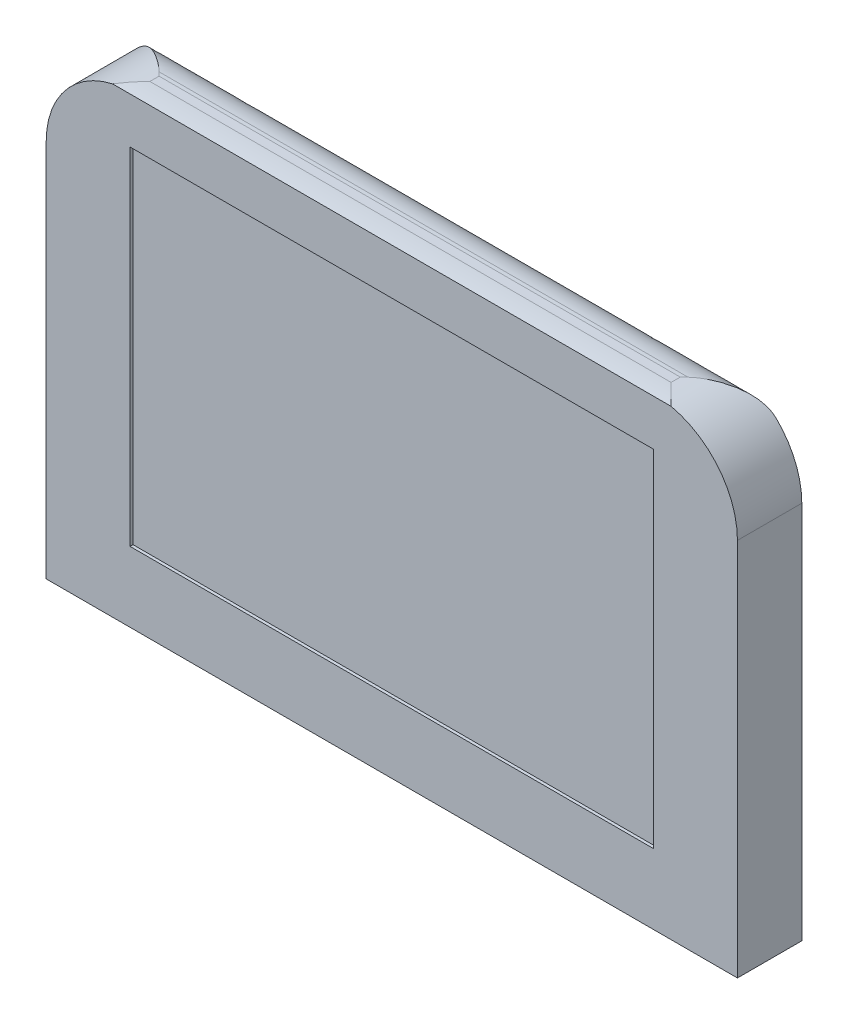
ISO-10303-21;
HEADER;
FILE_DESCRIPTION(('STEP AP214'),'2;1');
FILE_NAME('part.step','',(''),(''),'','','');
FILE_SCHEMA(('AUTOMOTIVE_DESIGN { 1 0 10303 214 1 1 1 1 }'));
ENDSEC;
DATA;
#1=APPLICATION_CONTEXT('core data for automotive mechanical design processes');
#2=APPLICATION_PROTOCOL_DEFINITION('international standard','automotive_design',2000,#1);
#3=PRODUCT_CONTEXT('',#1,'mechanical');
#4=PRODUCT('Part','Part','',(#3));
#5=PRODUCT_RELATED_PRODUCT_CATEGORY('part','',(#4));
#6=PRODUCT_DEFINITION_FORMATION('','',#4);
#7=PRODUCT_DEFINITION_CONTEXT('part definition',#1,'design');
#8=PRODUCT_DEFINITION('design','',#6,#7);
#9=PRODUCT_DEFINITION_SHAPE('','',#8);
#10=(LENGTH_UNIT() NAMED_UNIT(*) SI_UNIT(.MILLI.,.METRE.));
#11=(NAMED_UNIT(*) PLANE_ANGLE_UNIT() SI_UNIT($,.RADIAN.));
#12=(NAMED_UNIT(*) SI_UNIT($,.STERADIAN.) SOLID_ANGLE_UNIT());
#13=UNCERTAINTY_MEASURE_WITH_UNIT(LENGTH_MEASURE(1.E-05),#10,'distance_accuracy_value','');
#14=(GEOMETRIC_REPRESENTATION_CONTEXT(3) GLOBAL_UNCERTAINTY_ASSIGNED_CONTEXT((#13)) GLOBAL_UNIT_ASSIGNED_CONTEXT((#10,
#11,#12)) REPRESENTATION_CONTEXT('',''));
#15=CARTESIAN_POINT('',(0.,0.,0.));
#16=DIRECTION('',(0.,0.,1.));
#17=DIRECTION('',(1.,0.,0.));
#18=AXIS2_PLACEMENT_3D('',#15,#16,#17);
#19=CARTESIAN_POINT('',(0.,-78.2875,10.79));
#20=DIRECTION('',(0.,1.,0.));
#21=DIRECTION('',(-1.,0.,0.));
#22=AXIS2_PLACEMENT_3D('',#19,#20,#21);
#23=CYLINDRICAL_SURFACE('',#22,5.);
#24=CARTESIAN_POINT('',(0.,-78.2875,10.79));
#25=DIRECTION('',(0.,-1.,0.));
#26=DIRECTION('',(1.,0.,0.));
#27=AXIS2_PLACEMENT_3D('',#24,#25,#26);
#28=CIRCLE('',#27,5.);
#29=CARTESIAN_POINT('',(4.99999999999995,-78.2875,10.79));
#30=VERTEX_POINT('',#29);
#31=EDGE_CURVE('E11',#30,#30,#28,.T.);
#32=ORIENTED_EDGE('',*,*,#31,.F.);
#33=EDGE_LOOP('',(#32));
#34=FACE_BOUND('',#33,.T.);
#35=CARTESIAN_POINT('',(0.,-77.7875,10.79));
#36=DIRECTION('',(0.,-1.,0.));
#37=DIRECTION('',(1.,0.,0.));
#38=AXIS2_PLACEMENT_3D('',#35,#36,#37);
#39=CIRCLE('',#38,5.);
#40=CARTESIAN_POINT('',(4.99999999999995,-77.7875,10.79));
#41=VERTEX_POINT('',#40);
#42=EDGE_CURVE('E41',#41,#41,#39,.T.);
#43=ORIENTED_EDGE('',*,*,#42,.T.);
#44=EDGE_LOOP('',(#43));
#45=FACE_BOUND('',#44,.T.);
#46=ADVANCED_FACE('F38',(#34,#45),#23,.T.);
#47=CARTESIAN_POINT('',(0.,-78.2875,10.79));
#48=DIRECTION('',(0.,-1.,0.));
#49=DIRECTION('',(1.,0.,0.));
#50=AXIS2_PLACEMENT_3D('',#47,#48,#49);
#51=PLANE('',#50);
#52=ORIENTED_EDGE('',*,*,#31,.T.);
#53=EDGE_LOOP('',(#52));
#54=FACE_BOUND('',#53,.T.);
#55=ADVANCED_FACE('F53',(#54),#51,.T.);
#56=CARTESIAN_POINT('',(0.,-77.7875,10.79));
#57=DIRECTION('',(0.,-1.,0.));
#58=DIRECTION('',(1.,0.,0.));
#59=AXIS2_PLACEMENT_3D('',#56,#57,#58);
#60=PLANE('',#59);
#61=ORIENTED_EDGE('',*,*,#42,.F.);
#62=EDGE_LOOP('',(#61));
#63=FACE_BOUND('',#62,.T.);
#64=ADVANCED_FACE('F51',(#63),#60,.F.);
#65=CLOSED_SHELL('',(#46,#55,#64));
#66=MANIFOLD_SOLID_BREP('B2',#65);
#67=CARTESIAN_POINT('',(-115.8875,-77.7875,21.58));
#68=DIRECTION('',(1.,0.,0.));
#69=DIRECTION('',(0.,0.,-1.));
#70=AXIS2_PLACEMENT_3D('',#67,#68,#69);
#71=PLANE('',#70);
#72=DIRECTION('',(0.,-1.,0.));
#73=VECTOR('',#72,1.);
#74=CARTESIAN_POINT('',(-115.8875,-77.7875,21.58));
#75=LINE('',#74,#73);
#76=CARTESIAN_POINT('',(-115.8875,49.2875,21.58));
#77=VERTEX_POINT('',#76);
#78=CARTESIAN_POINT('',(-115.8875,-77.7875,21.58));
#79=VERTEX_POINT('',#78);
#80=EDGE_CURVE('E317',#77,#79,#75,.T.);
#81=ORIENTED_EDGE('',*,*,#80,.F.);
#82=DIRECTION('',(0.,0.,-1.));
#83=VECTOR('',#82,1.);
#84=CARTESIAN_POINT('',(-115.8875,49.2875,21.58));
#85=LINE('',#84,#83);
#86=CARTESIAN_POINT('',(-115.8875,49.2875,0.));
#87=VERTEX_POINT('',#86);
#88=EDGE_CURVE('E36',#77,#87,#85,.T.);
#89=ORIENTED_EDGE('',*,*,#88,.T.);
#90=DIRECTION('',(0.,-1.,0.));
#91=VECTOR('',#90,1.);
#92=CARTESIAN_POINT('',(-115.8875,-77.7875,0.));
#93=LINE('',#92,#91);
#94=CARTESIAN_POINT('',(-115.8875,-77.7875,0.));
#95=VERTEX_POINT('',#94);
#96=EDGE_CURVE('E293',#87,#95,#93,.T.);
#97=ORIENTED_EDGE('',*,*,#96,.T.);
#98=DIRECTION('',(0.,0.,-1.));
#99=VECTOR('',#98,1.);
#100=CARTESIAN_POINT('',(-115.8875,-77.7875,21.58));
#101=LINE('',#100,#99);
#102=EDGE_CURVE('E332',#79,#95,#101,.T.);
#103=ORIENTED_EDGE('',*,*,#102,.F.);
#104=EDGE_LOOP('',(#81,#89,#97,#103));
#105=FACE_BOUND('',#104,.T.);
#106=ADVANCED_FACE('F78',(#105),#71,.F.);
#107=CARTESIAN_POINT('',(115.8875,-77.7875,21.58));
#108=DIRECTION('',(0.,1.,0.));
#109=DIRECTION('',(-1.,0.,0.));
#110=AXIS2_PLACEMENT_3D('',#107,#108,#109);
#111=PLANE('',#110);
#112=DIRECTION('',(1.,0.,0.));
#113=VECTOR('',#112,1.);
#114=CARTESIAN_POINT('',(115.8875,-77.7875,0.));
#115=LINE('',#114,#113);
#116=CARTESIAN_POINT('',(115.8875,-77.7875,0.));
#117=VERTEX_POINT('',#116);
#118=EDGE_CURVE('E327',#95,#117,#115,.T.);
#119=ORIENTED_EDGE('',*,*,#118,.T.);
#120=DIRECTION('',(0.,0.,-1.));
#121=VECTOR('',#120,1.);
#122=CARTESIAN_POINT('',(115.8875,-77.7875,21.58));
#123=LINE('',#122,#121);
#124=CARTESIAN_POINT('',(115.8875,-77.7875,21.58));
#125=VERTEX_POINT('',#124);
#126=EDGE_CURVE('E325',#125,#117,#123,.T.);
#127=ORIENTED_EDGE('',*,*,#126,.F.);
#128=DIRECTION('',(1.,0.,0.));
#129=VECTOR('',#128,1.);
#130=CARTESIAN_POINT('',(115.8875,-77.7875,21.58));
#131=LINE('',#130,#129);
#132=EDGE_CURVE('E319',#79,#125,#131,.T.);
#133=ORIENTED_EDGE('',*,*,#132,.F.);
#134=ORIENTED_EDGE('',*,*,#102,.T.);
#135=EDGE_LOOP('',(#119,#127,#133,#134));
#136=FACE_BOUND('',#135,.T.);
#137=ADVANCED_FACE('F266',(#136),#111,.F.);
#138=CARTESIAN_POINT('',(115.8875,-77.7875,21.58));
#139=DIRECTION('',(-1.,0.,0.));
#140=DIRECTION('',(0.,-1.,0.));
#141=AXIS2_PLACEMENT_3D('',#138,#139,#140);
#142=PLANE('',#141);
#143=DIRECTION('',(0.,1.,0.));
#144=VECTOR('',#143,1.);
#145=CARTESIAN_POINT('',(115.8875,-77.7875,0.));
#146=LINE('',#145,#144);
#147=CARTESIAN_POINT('',(115.8875,49.2875,0.));
#148=VERTEX_POINT('',#147);
#149=EDGE_CURVE('E320',#117,#148,#146,.T.);
#150=ORIENTED_EDGE('',*,*,#149,.T.);
#151=DIRECTION('',(0.,0.,-1.));
#152=VECTOR('',#151,1.);
#153=CARTESIAN_POINT('',(115.8875,49.2875,21.58));
#154=LINE('',#153,#152);
#155=CARTESIAN_POINT('',(115.8875,49.2875,21.58));
#156=VERTEX_POINT('',#155);
#157=EDGE_CURVE('E300',#148,#156,#154,.F.);
#158=ORIENTED_EDGE('',*,*,#157,.T.);
#159=DIRECTION('',(0.,1.,0.));
#160=VECTOR('',#159,1.);
#161=CARTESIAN_POINT('',(115.8875,-77.7875,21.58));
#162=LINE('',#161,#160);
#163=EDGE_CURVE('E322',#125,#156,#162,.T.);
#164=ORIENTED_EDGE('',*,*,#163,.F.);
#165=ORIENTED_EDGE('',*,*,#126,.T.);
#166=EDGE_LOOP('',(#150,#158,#164,#165));
#167=FACE_BOUND('',#166,.T.);
#168=ADVANCED_FACE('F270',(#167),#142,.F.);
#169=CARTESIAN_POINT('',(115.8875,77.7875,21.58));
#170=DIRECTION('',(0.,-1.,0.));
#171=DIRECTION('',(1.,0.,0.));
#172=AXIS2_PLACEMENT_3D('',#169,#170,#171);
#173=PLANE('',#172);
#174=DIRECTION('',(0.,0.,-1.));
#175=VECTOR('',#174,1.);
#176=CARTESIAN_POINT('',(87.3874999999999,77.7875,21.58));
#177=LINE('',#176,#175);
#178=CARTESIAN_POINT('',(87.3874999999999,77.7875,15.3258384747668));
#179=VERTEX_POINT('',#178);
#180=CARTESIAN_POINT('',(87.3874999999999,77.7875,12.2468711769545));
#181=VERTEX_POINT('',#180);
#182=EDGE_CURVE('E339',#179,#181,#177,.T.);
#183=ORIENTED_EDGE('',*,*,#182,.T.);
#184=DIRECTION('',(1.,0.,0.));
#185=VECTOR('',#184,1.);
#186=CARTESIAN_POINT('',(115.8875,77.7875,12.2468711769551));
#187=LINE('',#186,#185);
#188=CARTESIAN_POINT('',(-87.3875,77.7875,12.2468711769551));
#189=VERTEX_POINT('',#188);
#190=EDGE_CURVE('E340',#181,#189,#187,.F.);
#191=ORIENTED_EDGE('',*,*,#190,.T.);
#192=DIRECTION('',(0.,0.,-1.));
#193=VECTOR('',#192,1.);
#194=CARTESIAN_POINT('',(-87.3875,77.7875,21.58));
#195=LINE('',#194,#193);
#196=CARTESIAN_POINT('',(-87.3875,77.7875,15.3258384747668));
#197=VERTEX_POINT('',#196);
#198=EDGE_CURVE('E335',#189,#197,#195,.F.);
#199=ORIENTED_EDGE('',*,*,#198,.T.);
#200=DIRECTION('',(1.,0.,0.));
#201=VECTOR('',#200,1.);
#202=CARTESIAN_POINT('',(115.8875,77.7875,15.3258384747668));
#203=LINE('',#202,#201);
#204=EDGE_CURVE('E337',#197,#179,#203,.T.);
#205=ORIENTED_EDGE('',*,*,#204,.T.);
#206=EDGE_LOOP('',(#183,#191,#199,#205));
#207=FACE_BOUND('',#206,.T.);
#208=ADVANCED_FACE('F274',(#207),#173,.F.);
#209=CARTESIAN_POINT('',(-115.8875,77.7875,21.58));
#210=DIRECTION('',(0.,0.,1.));
#211=DIRECTION('',(1.,0.,0.));
#212=AXIS2_PLACEMENT_3D('',#209,#210,#211);
#213=PLANE('',#212);
#214=DIRECTION('',(0.,-1.,0.));
#215=VECTOR('',#214,1.);
#216=CARTESIAN_POINT('',(-87.7875000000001,-54.2875,21.58));
#217=LINE('',#216,#215);
#218=CARTESIAN_POINT('',(-87.7875000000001,61.6928135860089,21.58));
#219=VERTEX_POINT('',#218);
#220=CARTESIAN_POINT('',(-87.7875000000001,-54.2875,21.58));
#221=VERTEX_POINT('',#220);
#222=EDGE_CURVE('E95',#219,#221,#217,.T.);
#223=ORIENTED_EDGE('',*,*,#222,.F.);
#224=DIRECTION('',(-1.,0.,0.));
#225=VECTOR('',#224,1.);
#226=CARTESIAN_POINT('',(87.7874999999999,61.6928135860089,21.58));
#227=LINE('',#226,#225);
#228=CARTESIAN_POINT('',(87.7874999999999,61.6928135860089,21.58));
#229=VERTEX_POINT('',#228);
#230=EDGE_CURVE('E194',#229,#219,#227,.T.);
#231=ORIENTED_EDGE('',*,*,#230,.F.);
#232=DIRECTION('',(0.,1.,0.));
#233=VECTOR('',#232,1.);
#234=CARTESIAN_POINT('',(87.7874999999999,-54.2875,21.58));
#235=LINE('',#234,#233);
#236=CARTESIAN_POINT('',(87.7874999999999,-54.2875,21.58));
#237=VERTEX_POINT('',#236);
#238=EDGE_CURVE('E197',#237,#229,#235,.T.);
#239=ORIENTED_EDGE('',*,*,#238,.F.);
#240=DIRECTION('',(1.,0.,0.));
#241=VECTOR('',#240,1.);
#242=CARTESIAN_POINT('',(87.7874999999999,-54.2875,21.58));
#243=LINE('',#242,#241);
#244=EDGE_CURVE('E203',#221,#237,#243,.T.);
#245=ORIENTED_EDGE('',*,*,#244,.F.);
#246=EDGE_LOOP('',(#223,#231,#239,#245));
#247=FACE_BOUND('',#246,.T.);
#248=ORIENTED_EDGE('',*,*,#163,.T.);
#249=CARTESIAN_POINT('',(87.3874999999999,49.2875,21.58));
#250=DIRECTION('',(0.,0.,1.));
#251=DIRECTION('',(1.,0.,0.));
#252=AXIS2_PLACEMENT_3D('',#249,#250,#251);
#253=CIRCLE('',#252,28.5);
#254=CARTESIAN_POINT('',(93.6416615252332,77.0928135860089,21.58));
#255=VERTEX_POINT('',#254);
#256=EDGE_CURVE('E87',#156,#255,#253,.T.);
#257=ORIENTED_EDGE('',*,*,#256,.T.);
#258=DIRECTION('',(1.,0.,0.));
#259=VECTOR('',#258,1.);
#260=CARTESIAN_POINT('',(-115.8875,77.0928135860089,21.58));
#261=LINE('',#260,#259);
#262=CARTESIAN_POINT('',(-93.6416615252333,77.0928135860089,21.58));
#263=VERTEX_POINT('',#262);
#264=EDGE_CURVE('E294',#263,#255,#261,.T.);
#265=ORIENTED_EDGE('',*,*,#264,.F.);
#266=CARTESIAN_POINT('',(-87.3875,49.2875,21.58));
#267=DIRECTION('',(0.,0.,1.));
#268=DIRECTION('',(1.,0.,0.));
#269=AXIS2_PLACEMENT_3D('',#266,#267,#268);
#270=CIRCLE('',#269,28.5);
#271=EDGE_CURVE('E103',#263,#77,#270,.T.);
#272=ORIENTED_EDGE('',*,*,#271,.T.);
#273=ORIENTED_EDGE('',*,*,#80,.T.);
#274=ORIENTED_EDGE('',*,*,#132,.T.);
#275=EDGE_LOOP('',(#248,#257,#265,#272,#273,#274));
#276=FACE_BOUND('',#275,.T.);
#277=ADVANCED_FACE('F231',(#247,#276),#213,.T.);
#278=CARTESIAN_POINT('',(-115.8875,77.7875,0.));
#279=DIRECTION('',(0.,0.,1.));
#280=DIRECTION('',(1.,0.,0.));
#281=AXIS2_PLACEMENT_3D('',#278,#279,#280);
#282=PLANE('',#281);
#283=DIRECTION('',(1.,0.,0.));
#284=VECTOR('',#283,1.);
#285=CARTESIAN_POINT('',(-115.8875,69.7875,0.));
#286=LINE('',#285,#284);
#287=CARTESIAN_POINT('',(-107.186489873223,69.7875,0.));
#288=VERTEX_POINT('',#287);
#289=CARTESIAN_POINT('',(107.186489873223,69.7875,0.));
#290=VERTEX_POINT('',#289);
#291=EDGE_CURVE('E217',#288,#290,#286,.T.);
#292=ORIENTED_EDGE('',*,*,#291,.T.);
#293=CARTESIAN_POINT('',(87.3874999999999,49.2875,0.));
#294=DIRECTION('',(0.,0.,1.));
#295=DIRECTION('',(1.,0.,0.));
#296=AXIS2_PLACEMENT_3D('',#293,#294,#295);
#297=CIRCLE('',#296,28.5);
#298=EDGE_CURVE('E288',#290,#148,#297,.F.);
#299=ORIENTED_EDGE('',*,*,#298,.T.);
#300=ORIENTED_EDGE('',*,*,#149,.F.);
#301=ORIENTED_EDGE('',*,*,#118,.F.);
#302=ORIENTED_EDGE('',*,*,#96,.F.);
#303=CARTESIAN_POINT('',(-87.3875,49.2875,0.));
#304=DIRECTION('',(0.,0.,1.));
#305=DIRECTION('',(1.,0.,0.));
#306=AXIS2_PLACEMENT_3D('',#303,#304,#305);
#307=CIRCLE('',#306,28.5);
#308=EDGE_CURVE('E248',#87,#288,#307,.F.);
#309=ORIENTED_EDGE('',*,*,#308,.T.);
#310=EDGE_LOOP('',(#292,#299,#300,#301,#302,#309));
#311=FACE_BOUND('',#310,.T.);
#312=ADVANCED_FACE('F228',(#311),#282,.F.);
#313=CARTESIAN_POINT('',(-115.8875,77.0928135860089,21.58));
#314=CARTESIAN_POINT('',(-115.8875,77.9333968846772,19.9146475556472));
#315=CARTESIAN_POINT('',(-115.8875,77.834654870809,15.4470430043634));
#316=CARTESIAN_POINT('',(-115.8875,77.7106660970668,5.20338045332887));
#317=CARTESIAN_POINT('',(-115.8875,73.9504674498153,0.44956625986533));
#318=CARTESIAN_POINT('',(-115.8875,69.9062340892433,-0.0246089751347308));
#319=CARTESIAN_POINT('',(-115.8875,69.0465337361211,0.));
#320=CARTESIAN_POINT('',(-115.8875,67.7874999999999,0.));
#321=B_SPLINE_CURVE_WITH_KNOTS('',3,(#313,#314,#315,#316,#317,#318,#319,#320),.UNSPECIFIED.,.F.,
.F.,(4,1,1,1,1,4),(0.,0.307991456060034,0.403452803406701,0.89337339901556,0.959152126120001,
1.),.UNSPECIFIED.);
#322=DIRECTION('',(1.,0.,0.));
#323=VECTOR('',#322,1.);
#324=SURFACE_OF_LINEAR_EXTRUSION('',#321,#323);
#325=DIRECTION('',(1.,0.,0.));
#326=VECTOR('',#325,1.);
#327=CARTESIAN_POINT('',(-115.8875,77.7576656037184,10.9431570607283));
#328=LINE('',#327,#326);
#329=CARTESIAN_POINT('',(-88.6912141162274,77.7576656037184,10.9431570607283));
#330=VERTEX_POINT('',#329);
#331=CARTESIAN_POINT('',(88.6912141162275,77.7576656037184,10.9431570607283));
#332=VERTEX_POINT('',#331);
#333=EDGE_CURVE('E249',#330,#332,#328,.T.);
#334=ORIENTED_EDGE('',*,*,#333,.T.);
#335=CARTESIAN_POINT('',(88.6912141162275,77.7576656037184,10.9431570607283));
#336=CARTESIAN_POINT('',(88.7523353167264,77.754865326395,10.8819781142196));
#337=CARTESIAN_POINT('',(88.8133824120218,77.7518739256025,10.8207324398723));
#338=CARTESIAN_POINT('',(88.9356208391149,77.7454881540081,10.6983997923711));
#339=CARTESIAN_POINT('',(88.9968121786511,77.7420937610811,10.6373128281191));
#340=CARTESIAN_POINT('',(89.1196300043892,77.7348812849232,10.5155914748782));
#341=CARTESIAN_POINT('',(89.181256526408,77.7310631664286,10.454957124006));
#342=CARTESIAN_POINT('',(89.3050839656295,77.7229835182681,10.3343090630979));
#343=CARTESIAN_POINT('',(89.3672848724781,77.7187219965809,10.2742953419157));
#344=CARTESIAN_POINT('',(89.4922836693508,77.7097413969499,10.1550737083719));
#345=CARTESIAN_POINT('',(89.5550807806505,77.7050228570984,10.0958649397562));
#346=CARTESIAN_POINT('',(89.681386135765,77.6951063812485,9.9782509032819));
#347=CARTESIAN_POINT('',(89.7448943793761,77.6899084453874,9.91984563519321));
#348=CARTESIAN_POINT('',(89.8726584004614,77.6790144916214,9.80391402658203));
#349=CARTESIAN_POINT('',(89.9369141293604,77.6733185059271,9.74638762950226));
#350=CARTESIAN_POINT('',(90.0660729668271,77.6614220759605,9.63211969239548));
#351=CARTESIAN_POINT('',(90.1309760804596,77.6552216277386,9.57537815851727));
#352=CARTESIAN_POINT('',(90.3264191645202,77.6358665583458,9.40611685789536));
#353=CARTESIAN_POINT('',(90.4577077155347,77.6219569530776,9.29454704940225));
#354=CARTESIAN_POINT('',(90.7216449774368,77.5921131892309,9.07329605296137));
#355=CARTESIAN_POINT('',(90.8542937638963,77.5761789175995,8.96361497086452));
#356=CARTESIAN_POINT('',(91.1206273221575,77.5422657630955,8.74574537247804));
#357=CARTESIAN_POINT('',(91.2543124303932,77.5242861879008,8.63755737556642));
#358=CARTESIAN_POINT('',(91.5224393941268,77.4862696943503,8.42249779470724));
#359=CARTESIAN_POINT('',(91.6568812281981,77.4662328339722,8.31562617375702));
#360=CARTESIAN_POINT('',(91.9263944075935,77.4240784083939,8.10304794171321));
#361=CARTESIAN_POINT('',(92.0614658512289,77.4019605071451,7.99734152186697));
#362=CARTESIAN_POINT('',(92.3321097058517,77.3556258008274,7.78703575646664));
#363=CARTESIAN_POINT('',(92.467682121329,77.3314089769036,7.68243642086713));
#364=CARTESIAN_POINT('',(92.8818668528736,77.2543038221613,7.36498848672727));
#365=CARTESIAN_POINT('',(93.1611562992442,77.1980166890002,7.15383524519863));
#366=CARTESIAN_POINT('',(93.7210606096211,77.0763127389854,6.73589422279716));
#367=CARTESIAN_POINT('',(94.0016756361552,77.0108947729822,6.52910699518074));
#368=CARTESIAN_POINT('',(94.5638908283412,76.8707076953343,6.12010433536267));
#369=CARTESIAN_POINT('',(94.8454909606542,76.7959388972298,5.91788875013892));
#370=CARTESIAN_POINT('',(95.4094151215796,76.6368090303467,5.51837274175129));
#371=CARTESIAN_POINT('',(95.6917390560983,76.5524491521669,5.32107171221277));
#372=CARTESIAN_POINT('',(96.2569190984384,76.3738660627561,4.93182595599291));
#373=CARTESIAN_POINT('',(96.5397751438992,76.2796439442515,4.73988063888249));
#374=CARTESIAN_POINT('',(97.0716488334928,76.0930367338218,4.38473409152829));
#375=CARTESIAN_POINT('',(97.3206242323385,76.0018060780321,4.22086274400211));
#376=CARTESIAN_POINT('',(97.8186980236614,75.811285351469,3.89816436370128));
#377=CARTESIAN_POINT('',(98.0677963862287,75.7119967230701,3.73933643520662));
#378=CARTESIAN_POINT('',(98.5659988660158,75.5051258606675,3.42724784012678));
#379=CARTESIAN_POINT('',(98.8151029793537,75.3975445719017,3.27398654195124));
#380=CARTESIAN_POINT('',(99.3132292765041,75.1738194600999,2.97361847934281));
#381=CARTESIAN_POINT('',(99.5622514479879,75.0576746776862,2.82651240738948));
#382=CARTESIAN_POINT('',(100.057091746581,74.8179941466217,2.5408904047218));
#383=CARTESIAN_POINT('',(100.302913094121,74.6945614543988,2.4022937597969));
#384=CARTESIAN_POINT('',(100.794127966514,74.4388221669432,2.13264003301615));
#385=CARTESIAN_POINT('',(101.039521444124,74.3065146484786,2.00158373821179));
#386=CARTESIAN_POINT('',(101.529623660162,74.0327847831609,1.74798122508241));
#387=CARTESIAN_POINT('',(101.7743324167,73.8913626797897,1.62543477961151));
#388=CARTESIAN_POINT('',(102.262854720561,73.5991195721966,1.38992869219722));
#389=CARTESIAN_POINT('',(102.506668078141,73.4482966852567,1.27697098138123));
#390=CARTESIAN_POINT('',(102.939384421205,73.1713761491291,1.08567224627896));
#391=CARTESIAN_POINT('',(103.128544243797,73.0471569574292,1.00518930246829));
#392=CARTESIAN_POINT('',(103.5058519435,72.792828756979,0.851569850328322));
#393=CARTESIAN_POINT('',(103.693999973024,72.6627206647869,0.778432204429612));
#394=CARTESIAN_POINT('',(104.068953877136,72.3966304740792,0.640318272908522));
#395=CARTESIAN_POINT('',(104.255760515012,72.2606520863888,0.575336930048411));
#396=CARTESIAN_POINT('',(104.627728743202,71.9828377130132,0.454405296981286));
#397=CARTESIAN_POINT('',(104.812891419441,71.8410060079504,0.398448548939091));
#398=CARTESIAN_POINT('',(105.184391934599,71.5490670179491,0.295624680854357));
#399=CARTESIAN_POINT('',(105.370698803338,71.398861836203,0.248922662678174));
#400=CARTESIAN_POINT('',(105.741040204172,71.0924380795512,0.16692376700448));
#401=CARTESIAN_POINT('',(105.92507375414,70.9362170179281,0.131631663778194));
#402=CARTESIAN_POINT('',(106.19907575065,70.6975289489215,0.0879650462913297));
#403=CARTESIAN_POINT('',(106.290155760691,70.6171600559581,0.0749466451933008));
#404=CARTESIAN_POINT('',(106.471499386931,70.4550637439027,0.051986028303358));
#405=CARTESIAN_POINT('',(106.561762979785,70.373336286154,0.0420439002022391));
#406=CARTESIAN_POINT('',(106.741691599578,70.2083082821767,0.0251146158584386));
#407=CARTESIAN_POINT('',(106.831353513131,70.1250033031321,0.0181377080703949));
#408=CARTESIAN_POINT('',(107.009683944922,69.9571613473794,0.0070021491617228));
#409=CARTESIAN_POINT('',(107.098352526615,69.8726244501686,0.00284331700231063));
#410=CARTESIAN_POINT('',(107.186489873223,69.7875,0.));
#411=B_SPLINE_CURVE_WITH_KNOTS('',3,(#335,#336,#337,#338,#339,#340,#341,#342,#343,#344,#345,
#346,#347,#348,#349,#350,#351,#352,#353,#354,#355,#356,#357,#358,#359,#360,#361,#362,#363,#364,
#365,#366,#367,#368,#369,#370,#371,#372,#373,#374,#375,#376,#377,#378,#379,#380,#381,#382,#383,
#384,#385,#386,#387,#388,#389,#390,#391,#392,#393,#394,#395,#396,#397,#398,#399,#400,#401,#402,
#403,#404,#405,#406,#407,#408,#409,#410),.UNSPECIFIED.,.F.,.F.,(4,2,2,2,2,2,2,2,2,2,2,2,2,2,2,2,
2,2,2,2,2,2,2,2,2,2,2,2,2,2,2,2,2,2,2,2,2,4),(0.,0.259575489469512,0.519165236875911,
0.778776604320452,1.03838330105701,1.29768796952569,1.55699256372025,1.81628040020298,
2.07557026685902,2.59409003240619,3.11263876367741,3.63136354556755,4.15007371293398,
4.66886778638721,5.18766652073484,6.25137298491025,7.31521344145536,8.37901823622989,
9.44269111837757,10.5062462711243,11.4412528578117,12.3760924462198,13.3108256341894,
14.2456637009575,15.1695010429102,16.0934346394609,17.017343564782,17.9414381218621,
18.6618289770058,19.3821080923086,20.1019383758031,20.8212512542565,21.5524254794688,
22.2839052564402,22.6503571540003,23.0168194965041,23.3845383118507,23.7522335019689),.UNSPECIFIED.);
#412=EDGE_CURVE('E243',#332,#290,#411,.T.);
#413=ORIENTED_EDGE('',*,*,#412,.T.);
#414=ORIENTED_EDGE('',*,*,#291,.F.);
#415=CARTESIAN_POINT('',(-107.186489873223,69.7875,0.));
#416=CARTESIAN_POINT('',(-107.09348252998,69.8773281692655,0.00299842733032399));
#417=CARTESIAN_POINT('',(-106.99988317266,69.966502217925,0.0074645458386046));
#418=CARTESIAN_POINT('',(-106.811583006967,70.1434747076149,0.0195463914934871));
#419=CARTESIAN_POINT('',(-106.716882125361,70.231273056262,0.0271623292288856));
#420=CARTESIAN_POINT('',(-106.526677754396,70.4052283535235,0.0457377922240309));
#421=CARTESIAN_POINT('',(-106.431176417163,70.4913884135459,0.0566901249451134));
#422=CARTESIAN_POINT('',(-106.239278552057,70.662180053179,0.0820410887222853));
#423=CARTESIAN_POINT('',(-106.142882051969,70.7468116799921,0.0964396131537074));
#424=CARTESIAN_POINT('',(-105.852638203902,70.9981916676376,0.144797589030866));
#425=CARTESIAN_POINT('',(-105.657575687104,71.1625721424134,0.183935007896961));
#426=CARTESIAN_POINT('',(-105.267556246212,71.4824627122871,0.274153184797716));
#427=CARTESIAN_POINT('',(-105.072633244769,71.638062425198,0.325066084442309));
#428=CARTESIAN_POINT('',(-104.680671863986,71.9426946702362,0.437863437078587));
#429=CARTESIAN_POINT('',(-104.483632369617,72.0917235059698,0.49975396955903));
#430=CARTESIAN_POINT('',(-104.087886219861,72.3831167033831,0.633386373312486));
#431=CARTESIAN_POINT('',(-103.889179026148,72.525478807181,0.705131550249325));
#432=CARTESIAN_POINT('',(-103.456660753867,72.8271023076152,0.870362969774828));
#433=CARTESIAN_POINT('',(-103.222612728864,72.9851338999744,0.965472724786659));
#434=CARTESIAN_POINT('',(-102.753157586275,73.2921923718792,1.16634453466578));
#435=CARTESIAN_POINT('',(-102.517750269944,73.4412178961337,1.27210818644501));
#436=CARTESIAN_POINT('',(-102.045879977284,73.7304641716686,1.49307386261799));
#437=CARTESIAN_POINT('',(-101.809416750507,73.8706827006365,1.60827825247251));
#438=CARTESIAN_POINT('',(-101.33578305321,74.1424782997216,1.8470282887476));
#439=CARTESIAN_POINT('',(-101.098612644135,74.2740560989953,1.97057322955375));
#440=CARTESIAN_POINT('',(-100.62056046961,74.5305322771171,2.22681335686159));
#441=CARTESIAN_POINT('',(-100.379671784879,74.6553166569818,2.35960946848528));
#442=CARTESIAN_POINT('',(-99.8976206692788,74.8964729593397,2.63198132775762));
#443=CARTESIAN_POINT('',(-99.6564583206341,75.0128469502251,2.77155539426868));
#444=CARTESIAN_POINT('',(-99.1739450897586,75.2374621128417,3.05681462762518));
#445=CARTESIAN_POINT('',(-98.9325941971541,75.345702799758,3.20250015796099));
#446=CARTESIAN_POINT('',(-98.4498205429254,75.5542893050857,3.49938726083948));
#447=CARTESIAN_POINT('',(-98.208397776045,75.654633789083,3.65058975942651));
#448=CARTESIAN_POINT('',(-97.6438887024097,75.8803109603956,4.01001255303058));
#449=CARTESIAN_POINT('',(-97.320834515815,76.0025979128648,4.22020133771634));
#450=CARTESIAN_POINT('',(-96.6750876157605,76.2338980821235,4.64846334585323));
#451=CARTESIAN_POINT('',(-96.3523950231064,76.3429077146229,4.86653867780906));
#452=CARTESIAN_POINT('',(-95.707604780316,76.5481008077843,5.3097509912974));
#453=CARTESIAN_POINT('',(-95.3855073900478,76.644279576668,5.53489051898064));
#454=CARTESIAN_POINT('',(-94.7422398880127,76.8241913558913,5.99154981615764));
#455=CARTESIAN_POINT('',(-94.4210700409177,76.9079211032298,6.2230712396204));
#456=CARTESIAN_POINT('',(-93.7800798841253,77.0632745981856,6.69199034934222));
#457=CARTESIAN_POINT('',(-93.4602596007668,77.1348981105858,6.92938814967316));
#458=CARTESIAN_POINT('',(-92.987035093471,77.2324467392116,7.28592216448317));
#459=CARTESIAN_POINT('',(-92.8329037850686,77.262883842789,7.40288087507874));
#460=CARTESIAN_POINT('',(-92.5251651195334,77.3210319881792,7.63815862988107));
#461=CARTESIAN_POINT('',(-92.3715577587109,77.3487430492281,7.75647766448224));
#462=CARTESIAN_POINT('',(-92.065020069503,77.4014642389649,7.99449681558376));
#463=CARTESIAN_POINT('',(-91.9120895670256,77.4264751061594,8.11419654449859));
#464=CARTESIAN_POINT('',(-91.6070157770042,77.4738355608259,8.35512350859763));
#465=CARTESIAN_POINT('',(-91.4548725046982,77.4961850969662,8.47635077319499));
#466=CARTESIAN_POINT('',(-91.1517185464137,77.5382355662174,8.72045108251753));
#467=CARTESIAN_POINT('',(-91.0007071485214,77.5579383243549,8.84332292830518));
#468=CARTESIAN_POINT('',(-90.7000802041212,77.5947380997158,9.09114706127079));
#469=CARTESIAN_POINT('',(-90.55046462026,77.6118351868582,9.21609929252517));
#470=CARTESIAN_POINT('',(-90.3276411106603,77.6355361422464,9.40556934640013));
#471=CARTESIAN_POINT('',(-90.2536526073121,77.6431106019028,9.46904925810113));
#472=CARTESIAN_POINT('',(-90.1063269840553,77.6576155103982,9.5968340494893));
#473=CARTESIAN_POINT('',(-90.0329898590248,77.6645459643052,9.66113892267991));
#474=CARTESIAN_POINT('',(-89.8871920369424,77.6777606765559,9.79080426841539));
#475=CARTESIAN_POINT('',(-89.8147313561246,77.6840449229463,9.85616476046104));
#476=CARTESIAN_POINT('',(-89.6707639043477,77.6959833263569,9.98798303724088));
#477=CARTESIAN_POINT('',(-89.5992571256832,77.7016374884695,10.0544408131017));
#478=CARTESIAN_POINT('',(-89.4570886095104,77.7123463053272,10.1883858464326));
#479=CARTESIAN_POINT('',(-89.3864274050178,77.7174005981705,10.2558736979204));
#480=CARTESIAN_POINT('',(-89.2458968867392,77.7269325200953,10.391712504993));
#481=CARTESIAN_POINT('',(-89.1760275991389,77.7314101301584,10.4600634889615));
#482=CARTESIAN_POINT('',(-89.036888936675,77.7398175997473,10.5974172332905));
#483=CARTESIAN_POINT('',(-88.9676196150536,77.7437474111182,10.6664200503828));
#484=CARTESIAN_POINT('',(-88.8639184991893,77.7492530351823,10.7701409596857));
#485=CARTESIAN_POINT('',(-88.8293866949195,77.7510233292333,10.8047492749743));
#486=CARTESIAN_POINT('',(-88.7603201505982,77.7544379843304,10.8739686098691));
#487=CARTESIAN_POINT('',(-88.7257854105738,77.7560823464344,10.9085796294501));
#488=CARTESIAN_POINT('',(-88.6912141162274,77.7576656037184,10.9431570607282));
#489=B_SPLINE_CURVE_WITH_KNOTS('',3,(#415,#416,#417,#418,#419,#420,#421,#422,#423,#424,#425,
#426,#427,#428,#429,#430,#431,#432,#433,#434,#435,#436,#437,#438,#439,#440,#441,#442,#443,#444,
#445,#446,#447,#448,#449,#450,#451,#452,#453,#454,#455,#456,#457,#458,#459,#460,#461,#462,#463,
#464,#465,#466,#467,#468,#469,#470,#471,#472,#473,#474,#475,#476,#477,#478,#479,#480,#481,#482,
#483,#484,#485,#486,#487,#488),.UNSPECIFIED.,.F.,.F.,(4,2,2,2,2,2,2,2,2,2,2,2,2,2,2,2,2,2,2,2,2,
2,2,2,2,2,2,2,2,2,2,2,2,2,2,2,4),(0.,0.388012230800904,0.776050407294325,1.1632579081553,
1.55045343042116,2.32419024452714,3.08751193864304,3.85125769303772,4.61526026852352,
5.50886196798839,6.40259780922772,7.29655827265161,8.19044320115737,9.09638218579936,
10.0020976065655,10.9078669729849,11.8137890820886,13.0265038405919,14.2395452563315,
15.4530290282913,16.6668303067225,17.8806551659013,18.4682240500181,19.0557887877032,
19.6431924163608,20.2306073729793,20.8176151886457,21.4046072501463,21.6979481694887,
21.9912867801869,22.2846308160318,22.5779724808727,22.8714902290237,23.1650176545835,
23.4585708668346,23.6053353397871,23.75209857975),.UNSPECIFIED.);
#490=EDGE_CURVE('E235',#288,#330,#489,.T.);
#491=ORIENTED_EDGE('',*,*,#490,.T.);
#492=EDGE_LOOP('',(#334,#413,#414,#491));
#493=FACE_BOUND('',#492,.T.);
#494=ADVANCED_FACE('F223',(#493),#324,.F.);
#495=CARTESIAN_POINT('',(0.,49.2875,15.3258384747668));
#496=DIRECTION('',(1.,0.,0.));
#497=DIRECTION('',(0.,0.,-1.));
#498=AXIS2_PLACEMENT_3D('',#495,#496,#497);
#499=CYLINDRICAL_SURFACE('',#498,28.5);
#500=CARTESIAN_POINT('',(-87.3875,49.2875,15.3258384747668));
#501=DIRECTION('',(-0.707106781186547,0.,-0.707106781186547));
#502=DIRECTION('',(0.707106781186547,0.,-0.707106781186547));
#503=AXIS2_PLACEMENT_3D('',#500,#501,#502);
#504=ELLIPSE('',#503,40.3050865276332,28.5);
#505=EDGE_CURVE('E307',#263,#197,#504,.T.);
#506=ORIENTED_EDGE('',*,*,#505,.F.);
#507=ORIENTED_EDGE('',*,*,#264,.T.);
#508=CARTESIAN_POINT('',(87.3874999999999,49.2875,15.3258384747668));
#509=DIRECTION('',(0.707106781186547,0.,-0.707106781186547));
#510=DIRECTION('',(0.707106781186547,0.,0.707106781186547));
#511=AXIS2_PLACEMENT_3D('',#508,#509,#510);
#512=ELLIPSE('',#511,40.3050865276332,28.5);
#513=EDGE_CURVE('E82',#179,#255,#512,.T.);
#514=ORIENTED_EDGE('',*,*,#513,.F.);
#515=ORIENTED_EDGE('',*,*,#204,.F.);
#516=EDGE_LOOP('',(#506,#507,#514,#515));
#517=FACE_BOUND('',#516,.T.);
#518=ADVANCED_FACE('F80',(#517),#499,.T.);
#519=CARTESIAN_POINT('',(87.3874999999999,49.2875,21.58));
#520=DIRECTION('',(0.,0.,-1.));
#521=DIRECTION('',(-1.,0.,0.));
#522=AXIS2_PLACEMENT_3D('',#519,#520,#521);
#523=CYLINDRICAL_SURFACE('',#522,28.5);
#524=ORIENTED_EDGE('',*,*,#298,.F.);
#525=ORIENTED_EDGE('',*,*,#412,.F.);
#526=CARTESIAN_POINT('',(87.3874999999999,49.2875,12.2468711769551));
#527=DIRECTION('',(-0.707106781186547,0.,-0.707106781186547));
#528=DIRECTION('',(0.707106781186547,0.,-0.707106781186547));
#529=AXIS2_PLACEMENT_3D('',#526,#527,#528);
#530=ELLIPSE('',#529,40.3050865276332,28.5);
#531=EDGE_CURVE('E306',#181,#332,#530,.T.);
#532=ORIENTED_EDGE('',*,*,#531,.F.);
#533=ORIENTED_EDGE('',*,*,#182,.F.);
#534=ORIENTED_EDGE('',*,*,#513,.T.);
#535=ORIENTED_EDGE('',*,*,#256,.F.);
#536=ORIENTED_EDGE('',*,*,#157,.F.);
#537=EDGE_LOOP('',(#524,#525,#532,#533,#534,#535,#536));
#538=FACE_BOUND('',#537,.T.);
#539=ADVANCED_FACE('F251',(#538),#523,.T.);
#540=CARTESIAN_POINT('',(-87.3875,49.2875,21.58));
#541=DIRECTION('',(0.,0.,-1.));
#542=DIRECTION('',(-1.,0.,0.));
#543=AXIS2_PLACEMENT_3D('',#540,#541,#542);
#544=CYLINDRICAL_SURFACE('',#543,28.5);
#545=ORIENTED_EDGE('',*,*,#505,.T.);
#546=ORIENTED_EDGE('',*,*,#198,.F.);
#547=CARTESIAN_POINT('',(-87.3875,49.2875,12.2468711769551));
#548=DIRECTION('',(0.707106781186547,0.,-0.707106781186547));
#549=DIRECTION('',(-0.707106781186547,0.,-0.707106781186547));
#550=AXIS2_PLACEMENT_3D('',#547,#548,#549);
#551=ELLIPSE('',#550,40.3050865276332,28.5);
#552=EDGE_CURVE('E209',#330,#189,#551,.T.);
#553=ORIENTED_EDGE('',*,*,#552,.F.);
#554=ORIENTED_EDGE('',*,*,#490,.F.);
#555=ORIENTED_EDGE('',*,*,#308,.F.);
#556=ORIENTED_EDGE('',*,*,#88,.F.);
#557=ORIENTED_EDGE('',*,*,#271,.F.);
#558=EDGE_LOOP('',(#545,#546,#553,#554,#555,#556,#557));
#559=FACE_BOUND('',#558,.T.);
#560=ADVANCED_FACE('F254',(#559),#544,.T.);
#561=CARTESIAN_POINT('',(0.,49.2875,12.2468711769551));
#562=DIRECTION('',(1.,0.,0.));
#563=DIRECTION('',(0.,0.,-1.));
#564=AXIS2_PLACEMENT_3D('',#561,#562,#563);
#565=CYLINDRICAL_SURFACE('',#564,28.5);
#566=ORIENTED_EDGE('',*,*,#531,.T.);
#567=ORIENTED_EDGE('',*,*,#333,.F.);
#568=ORIENTED_EDGE('',*,*,#552,.T.);
#569=ORIENTED_EDGE('',*,*,#190,.F.);
#570=EDGE_LOOP('',(#566,#567,#568,#569));
#571=FACE_BOUND('',#570,.T.);
#572=ADVANCED_FACE('F259',(#571),#565,.T.);
#573=CARTESIAN_POINT('',(-87.7875000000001,-54.2875,20.58));
#574=DIRECTION('',(-1.,0.,0.));
#575=DIRECTION('',(0.,0.,1.));
#576=AXIS2_PLACEMENT_3D('',#573,#574,#575);
#577=PLANE('',#576);
#578=ORIENTED_EDGE('',*,*,#222,.T.);
#579=DIRECTION('',(0.,0.,1.));
#580=VECTOR('',#579,1.);
#581=CARTESIAN_POINT('',(-87.7875000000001,-54.2875,20.58));
#582=LINE('',#581,#580);
#583=CARTESIAN_POINT('',(-87.7875000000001,-54.2875,20.58));
#584=VERTEX_POINT('',#583);
#585=EDGE_CURVE('E172',#584,#221,#582,.T.);
#586=ORIENTED_EDGE('',*,*,#585,.F.);
#587=DIRECTION('',(0.,-1.,0.));
#588=VECTOR('',#587,1.);
#589=CARTESIAN_POINT('',(-87.7875000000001,-54.2875,20.58));
#590=LINE('',#589,#588);
#591=CARTESIAN_POINT('',(-87.7875000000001,61.6928135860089,20.58));
#592=VERTEX_POINT('',#591);
#593=EDGE_CURVE('E176',#592,#584,#590,.T.);
#594=ORIENTED_EDGE('',*,*,#593,.F.);
#595=DIRECTION('',(0.,0.,1.));
#596=VECTOR('',#595,1.);
#597=CARTESIAN_POINT('',(-87.7875000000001,61.6928135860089,20.58));
#598=LINE('',#597,#596);
#599=EDGE_CURVE('E207',#592,#219,#598,.T.);
#600=ORIENTED_EDGE('',*,*,#599,.T.);
#601=EDGE_LOOP('',(#578,#586,#594,#600));
#602=FACE_BOUND('',#601,.T.);
#603=ADVANCED_FACE('F174',(#602),#577,.F.);
#604=CARTESIAN_POINT('',(87.7874999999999,61.6928135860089,20.58));
#605=DIRECTION('',(0.,1.,0.));
#606=DIRECTION('',(0.,0.,1.));
#607=AXIS2_PLACEMENT_3D('',#604,#605,#606);
#608=PLANE('',#607);
#609=ORIENTED_EDGE('',*,*,#230,.T.);
#610=ORIENTED_EDGE('',*,*,#599,.F.);
#611=DIRECTION('',(-1.,0.,0.));
#612=VECTOR('',#611,1.);
#613=CARTESIAN_POINT('',(87.7874999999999,61.6928135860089,20.58));
#614=LINE('',#613,#612);
#615=CARTESIAN_POINT('',(87.7874999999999,61.6928135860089,20.58));
#616=VERTEX_POINT('',#615);
#617=EDGE_CURVE('E182',#616,#592,#614,.T.);
#618=ORIENTED_EDGE('',*,*,#617,.F.);
#619=DIRECTION('',(0.,0.,1.));
#620=VECTOR('',#619,1.);
#621=CARTESIAN_POINT('',(87.7874999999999,61.6928135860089,20.58));
#622=LINE('',#621,#620);
#623=EDGE_CURVE('E210',#616,#229,#622,.T.);
#624=ORIENTED_EDGE('',*,*,#623,.T.);
#625=EDGE_LOOP('',(#609,#610,#618,#624));
#626=FACE_BOUND('',#625,.T.);
#627=ADVANCED_FACE('F376',(#626),#608,.F.);
#628=CARTESIAN_POINT('',(87.7874999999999,-54.2875,20.58));
#629=DIRECTION('',(1.,0.,0.));
#630=DIRECTION('',(0.,1.,0.));
#631=AXIS2_PLACEMENT_3D('',#628,#629,#630);
#632=PLANE('',#631);
#633=ORIENTED_EDGE('',*,*,#238,.T.);
#634=ORIENTED_EDGE('',*,*,#623,.F.);
#635=DIRECTION('',(0.,1.,0.));
#636=VECTOR('',#635,1.);
#637=CARTESIAN_POINT('',(87.7874999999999,-54.2875,20.58));
#638=LINE('',#637,#636);
#639=CARTESIAN_POINT('',(87.7874999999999,-54.2875,20.58));
#640=VERTEX_POINT('',#639);
#641=EDGE_CURVE('E190',#640,#616,#638,.T.);
#642=ORIENTED_EDGE('',*,*,#641,.F.);
#643=DIRECTION('',(0.,0.,1.));
#644=VECTOR('',#643,1.);
#645=CARTESIAN_POINT('',(87.7874999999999,-54.2875,20.58));
#646=LINE('',#645,#644);
#647=EDGE_CURVE('E181',#640,#237,#646,.T.);
#648=ORIENTED_EDGE('',*,*,#647,.T.);
#649=EDGE_LOOP('',(#633,#634,#642,#648));
#650=FACE_BOUND('',#649,.T.);
#651=ADVANCED_FACE('F382',(#650),#632,.F.);
#652=CARTESIAN_POINT('',(87.7874999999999,-54.2875,20.58));
#653=DIRECTION('',(0.,-1.,0.));
#654=DIRECTION('',(0.,0.,-1.));
#655=AXIS2_PLACEMENT_3D('',#652,#653,#654);
#656=PLANE('',#655);
#657=ORIENTED_EDGE('',*,*,#244,.T.);
#658=ORIENTED_EDGE('',*,*,#647,.F.);
#659=DIRECTION('',(1.,0.,0.));
#660=VECTOR('',#659,1.);
#661=CARTESIAN_POINT('',(87.7874999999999,-54.2875,20.58));
#662=LINE('',#661,#660);
#663=EDGE_CURVE('E185',#584,#640,#662,.T.);
#664=ORIENTED_EDGE('',*,*,#663,.F.);
#665=ORIENTED_EDGE('',*,*,#585,.T.);
#666=EDGE_LOOP('',(#657,#658,#664,#665));
#667=FACE_BOUND('',#666,.T.);
#668=ADVANCED_FACE('F186',(#667),#656,.F.);
#669=CARTESIAN_POINT('',(-87.7875000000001,61.6928135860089,20.58));
#670=DIRECTION('',(0.,0.,1.));
#671=DIRECTION('',(1.,0.,0.));
#672=AXIS2_PLACEMENT_3D('',#669,#670,#671);
#673=PLANE('',#672);
#674=ORIENTED_EDGE('',*,*,#593,.T.);
#675=ORIENTED_EDGE('',*,*,#663,.T.);
#676=ORIENTED_EDGE('',*,*,#641,.T.);
#677=ORIENTED_EDGE('',*,*,#617,.T.);
#678=EDGE_LOOP('',(#674,#675,#676,#677));
#679=FACE_BOUND('',#678,.T.);
#680=ADVANCED_FACE('F192',(#679),#673,.T.);
#681=CLOSED_SHELL('',(#106,#137,#168,#208,#277,#312,#494,#518,#539,#560,#572,#603,#627,#651,
#668,#680));
#682=MANIFOLD_SOLID_BREP('B6',#681);
#683=ADVANCED_BREP_SHAPE_REPRESENTATION('',(#18,#66,#682),#14);
#684=SHAPE_DEFINITION_REPRESENTATION(#9,#683);
ENDSEC;
END-ISO-10303-21;
